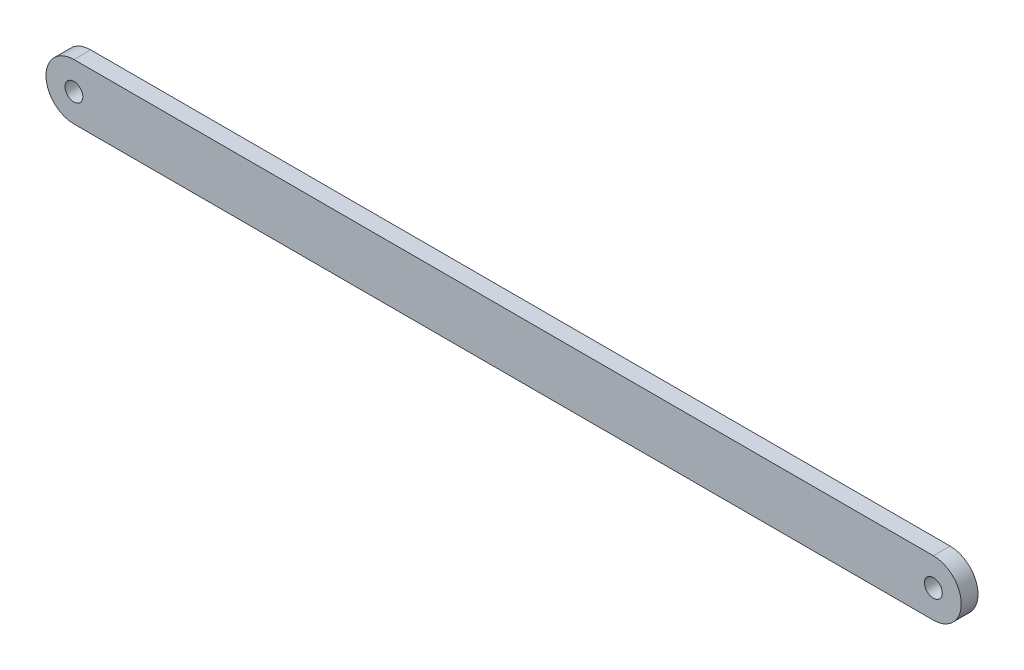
from build123d import *

# Parameters (mm, degrees)
ESQUISSE1_R        = 1.6
BOSS_EXTRU_1_DEPTH = 3


with BuildPart() as part:
    # Esquisse1 → Boss.-Extru.1 (new body)
    with BuildSketch(Plane.XY):
        with BuildLine():
            Line((26, 31), (180, 31))
            ThreePointArc((180, 31), (185, 26), (180, 21))
            Line((180, 21), (26, 21))
            ThreePointArc((26, 21), (21, 26), (26, 31))
        make_face()
        with Locations((180, 26)):
            Circle(ESQUISSE1_R, mode=Mode.SUBTRACT)
        with Locations((26, 26)):
            Circle(ESQUISSE1_R, mode=Mode.SUBTRACT)
    extrude(amount=BOSS_EXTRU_1_DEPTH)


solid = part.part
